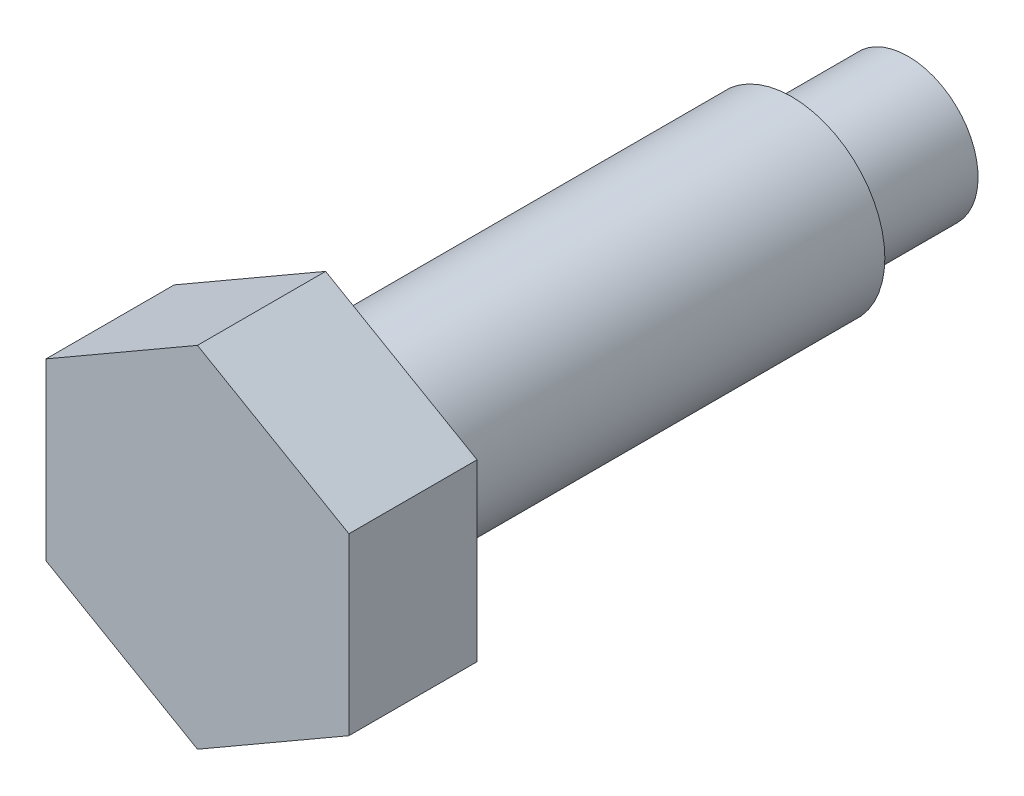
ISO-10303-21;
HEADER;
FILE_DESCRIPTION(('STEP AP214'),'2;1');
FILE_NAME('part.step','',(''),(''),'','','');
FILE_SCHEMA(('AUTOMOTIVE_DESIGN { 1 0 10303 214 1 1 1 1 }'));
ENDSEC;
DATA;
#1=APPLICATION_CONTEXT('core data for automotive mechanical design processes');
#2=APPLICATION_PROTOCOL_DEFINITION('international standard','automotive_design',2000,#1);
#3=PRODUCT_CONTEXT('',#1,'mechanical');
#4=PRODUCT('Part','Part','',(#3));
#5=PRODUCT_RELATED_PRODUCT_CATEGORY('part','',(#4));
#6=PRODUCT_DEFINITION_FORMATION('','',#4);
#7=PRODUCT_DEFINITION_CONTEXT('part definition',#1,'design');
#8=PRODUCT_DEFINITION('design','',#6,#7);
#9=PRODUCT_DEFINITION_SHAPE('','',#8);
#10=(LENGTH_UNIT() NAMED_UNIT(*) SI_UNIT(.MILLI.,.METRE.));
#11=(NAMED_UNIT(*) PLANE_ANGLE_UNIT() SI_UNIT($,.RADIAN.));
#12=(NAMED_UNIT(*) SI_UNIT($,.STERADIAN.) SOLID_ANGLE_UNIT());
#13=UNCERTAINTY_MEASURE_WITH_UNIT(LENGTH_MEASURE(1.E-05),#10,'distance_accuracy_value','');
#14=(GEOMETRIC_REPRESENTATION_CONTEXT(3) GLOBAL_UNCERTAINTY_ASSIGNED_CONTEXT((#13)) GLOBAL_UNIT_ASSIGNED_CONTEXT((#10,
#11,#12)) REPRESENTATION_CONTEXT('',''));
#15=CARTESIAN_POINT('',(0.,0.,0.));
#16=DIRECTION('',(0.,0.,1.));
#17=DIRECTION('',(1.,0.,0.));
#18=AXIS2_PLACEMENT_3D('',#15,#16,#17);
#19=CARTESIAN_POINT('',(0.,-7.50555349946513,0.));
#20=DIRECTION('',(0.,0.,1.));
#21=DIRECTION('',(0.,1.,0.));
#22=AXIS2_PLACEMENT_3D('',#19,#20,#21);
#23=PLANE('',#22);
#24=DIRECTION('',(0.866025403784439,-0.5,0.));
#25=VECTOR('',#24,1.);
#26=CARTESIAN_POINT('',(-6.5,-3.75277674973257,0.));
#27=LINE('',#26,#25);
#28=CARTESIAN_POINT('',(-6.5,-3.75277674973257,0.));
#29=VERTEX_POINT('',#28);
#30=CARTESIAN_POINT('',(0.,-7.50555349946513,0.));
#31=VERTEX_POINT('',#30);
#32=EDGE_CURVE('E72',#29,#31,#27,.T.);
#33=ORIENTED_EDGE('',*,*,#32,.F.);
#34=DIRECTION('',(0.,-1.,0.));
#35=VECTOR('',#34,1.);
#36=CARTESIAN_POINT('',(-6.5,3.75277674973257,0.));
#37=LINE('',#36,#35);
#38=CARTESIAN_POINT('',(-6.5,3.75277674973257,0.));
#39=VERTEX_POINT('',#38);
#40=EDGE_CURVE('E99',#39,#29,#37,.T.);
#41=ORIENTED_EDGE('',*,*,#40,.F.);
#42=DIRECTION('',(-0.866025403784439,-0.5,0.));
#43=VECTOR('',#42,1.);
#44=CARTESIAN_POINT('',(0.,7.50555349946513,0.));
#45=LINE('',#44,#43);
#46=CARTESIAN_POINT('',(0.,7.50555349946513,0.));
#47=VERTEX_POINT('',#46);
#48=EDGE_CURVE('E97',#47,#39,#45,.T.);
#49=ORIENTED_EDGE('',*,*,#48,.F.);
#50=DIRECTION('',(-0.866025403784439,0.5,0.));
#51=VECTOR('',#50,1.);
#52=CARTESIAN_POINT('',(6.5,3.75277674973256,0.));
#53=LINE('',#52,#51);
#54=CARTESIAN_POINT('',(6.5,3.75277674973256,0.));
#55=VERTEX_POINT('',#54);
#56=EDGE_CURVE('E95',#55,#47,#53,.T.);
#57=ORIENTED_EDGE('',*,*,#56,.F.);
#58=DIRECTION('',(0.,1.,0.));
#59=VECTOR('',#58,1.);
#60=CARTESIAN_POINT('',(6.5,-3.75277674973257,0.));
#61=LINE('',#60,#59);
#62=CARTESIAN_POINT('',(6.5,-3.75277674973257,0.));
#63=VERTEX_POINT('',#62);
#64=EDGE_CURVE('E74',#63,#55,#61,.T.);
#65=ORIENTED_EDGE('',*,*,#64,.F.);
#66=DIRECTION('',(0.866025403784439,0.5,0.));
#67=VECTOR('',#66,1.);
#68=CARTESIAN_POINT('',(0.,-7.50555349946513,0.));
#69=LINE('',#68,#67);
#70=EDGE_CURVE('E67',#31,#63,#69,.T.);
#71=ORIENTED_EDGE('',*,*,#70,.F.);
#72=EDGE_LOOP('',(#33,#41,#49,#57,#65,#71));
#73=FACE_BOUND('',#72,.T.);
#74=CARTESIAN_POINT('',(0.,0.,0.));
#75=DIRECTION('',(0.,0.,1.));
#76=DIRECTION('',(0.,1.,0.));
#77=AXIS2_PLACEMENT_3D('',#74,#75,#76);
#78=CIRCLE('',#77,4.);
#79=CARTESIAN_POINT('',(0.,4.,0.));
#80=VERTEX_POINT('',#79);
#81=EDGE_CURVE('E9',#80,#80,#78,.F.);
#82=ORIENTED_EDGE('',*,*,#81,.F.);
#83=EDGE_LOOP('',(#82));
#84=FACE_BOUND('',#83,.T.);
#85=ADVANCED_FACE('F14',(#73,#84),#23,.F.);
#86=CARTESIAN_POINT('',(-6.5,-3.75277674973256,5.5));
#87=DIRECTION('',(0.5,0.866025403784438,0.));
#88=DIRECTION('',(-0.866025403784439,0.5,0.));
#89=AXIS2_PLACEMENT_3D('',#86,#87,#88);
#90=PLANE('',#89);
#91=ORIENTED_EDGE('',*,*,#32,.T.);
#92=DIRECTION('',(0.,0.,-1.));
#93=VECTOR('',#92,1.);
#94=CARTESIAN_POINT('',(0.,-7.50555349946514,5.5));
#95=LINE('',#94,#93);
#96=CARTESIAN_POINT('',(0.,-7.50555349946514,5.5));
#97=VERTEX_POINT('',#96);
#98=EDGE_CURVE('E22',#97,#31,#95,.T.);
#99=ORIENTED_EDGE('',*,*,#98,.F.);
#100=DIRECTION('',(0.866025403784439,-0.5,0.));
#101=VECTOR('',#100,1.);
#102=CARTESIAN_POINT('',(-6.5,-3.75277674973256,5.5));
#103=LINE('',#102,#101);
#104=CARTESIAN_POINT('',(-6.5,-3.75277674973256,5.5));
#105=VERTEX_POINT('',#104);
#106=EDGE_CURVE('E101',#105,#97,#103,.T.);
#107=ORIENTED_EDGE('',*,*,#106,.F.);
#108=DIRECTION('',(0.,0.,-1.));
#109=VECTOR('',#108,1.);
#110=CARTESIAN_POINT('',(-6.5,-3.75277674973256,5.5));
#111=LINE('',#110,#109);
#112=EDGE_CURVE('E86',#105,#29,#111,.T.);
#113=ORIENTED_EDGE('',*,*,#112,.T.);
#114=EDGE_LOOP('',(#91,#99,#107,#113));
#115=FACE_BOUND('',#114,.T.);
#116=ADVANCED_FACE('F16',(#115),#90,.F.);
#117=CARTESIAN_POINT('',(0.,-7.50555349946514,5.5));
#118=DIRECTION('',(-0.5,0.866025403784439,0.));
#119=DIRECTION('',(-0.866025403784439,-0.5,0.));
#120=AXIS2_PLACEMENT_3D('',#117,#118,#119);
#121=PLANE('',#120);
#122=ORIENTED_EDGE('',*,*,#70,.T.);
#123=DIRECTION('',(0.,0.,-1.));
#124=VECTOR('',#123,1.);
#125=CARTESIAN_POINT('',(6.5,-3.75277674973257,5.5));
#126=LINE('',#125,#124);
#127=CARTESIAN_POINT('',(6.5,-3.75277674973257,5.5));
#128=VERTEX_POINT('',#127);
#129=EDGE_CURVE('E84',#128,#63,#126,.T.);
#130=ORIENTED_EDGE('',*,*,#129,.F.);
#131=DIRECTION('',(0.866025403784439,0.5,0.));
#132=VECTOR('',#131,1.);
#133=CARTESIAN_POINT('',(0.,-7.50555349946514,5.5));
#134=LINE('',#133,#132);
#135=EDGE_CURVE('E81',#97,#128,#134,.T.);
#136=ORIENTED_EDGE('',*,*,#135,.F.);
#137=ORIENTED_EDGE('',*,*,#98,.T.);
#138=EDGE_LOOP('',(#122,#130,#136,#137));
#139=FACE_BOUND('',#138,.T.);
#140=ADVANCED_FACE('F80',(#139),#121,.F.);
#141=CARTESIAN_POINT('',(6.5,-3.75277674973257,5.5));
#142=DIRECTION('',(-1.,0.,0.));
#143=DIRECTION('',(0.,-1.,0.));
#144=AXIS2_PLACEMENT_3D('',#141,#142,#143);
#145=PLANE('',#144);
#146=ORIENTED_EDGE('',*,*,#64,.T.);
#147=DIRECTION('',(0.,0.,-1.));
#148=VECTOR('',#147,1.);
#149=CARTESIAN_POINT('',(6.5,3.75277674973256,5.5));
#150=LINE('',#149,#148);
#151=CARTESIAN_POINT('',(6.5,3.75277674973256,5.5));
#152=VERTEX_POINT('',#151);
#153=EDGE_CURVE('E117',#152,#55,#150,.T.);
#154=ORIENTED_EDGE('',*,*,#153,.F.);
#155=DIRECTION('',(0.,1.,0.));
#156=VECTOR('',#155,1.);
#157=CARTESIAN_POINT('',(6.5,-3.75277674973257,5.5));
#158=LINE('',#157,#156);
#159=EDGE_CURVE('E104',#128,#152,#158,.T.);
#160=ORIENTED_EDGE('',*,*,#159,.F.);
#161=ORIENTED_EDGE('',*,*,#129,.T.);
#162=EDGE_LOOP('',(#146,#154,#160,#161));
#163=FACE_BOUND('',#162,.T.);
#164=ADVANCED_FACE('F122',(#163),#145,.F.);
#165=CARTESIAN_POINT('',(6.5,3.75277674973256,5.5));
#166=DIRECTION('',(-0.5,-0.866025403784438,0.));
#167=DIRECTION('',(0.866025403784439,-0.5,0.));
#168=AXIS2_PLACEMENT_3D('',#165,#166,#167);
#169=PLANE('',#168);
#170=ORIENTED_EDGE('',*,*,#56,.T.);
#171=DIRECTION('',(0.,0.,-1.));
#172=VECTOR('',#171,1.);
#173=CARTESIAN_POINT('',(0.,7.50555349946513,5.5));
#174=LINE('',#173,#172);
#175=CARTESIAN_POINT('',(0.,7.50555349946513,5.5));
#176=VERTEX_POINT('',#175);
#177=EDGE_CURVE('E114',#176,#47,#174,.T.);
#178=ORIENTED_EDGE('',*,*,#177,.F.);
#179=DIRECTION('',(-0.866025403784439,0.5,0.));
#180=VECTOR('',#179,1.);
#181=CARTESIAN_POINT('',(6.5,3.75277674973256,5.5));
#182=LINE('',#181,#180);
#183=EDGE_CURVE('E106',#152,#176,#182,.T.);
#184=ORIENTED_EDGE('',*,*,#183,.F.);
#185=ORIENTED_EDGE('',*,*,#153,.T.);
#186=EDGE_LOOP('',(#170,#178,#184,#185));
#187=FACE_BOUND('',#186,.T.);
#188=ADVANCED_FACE('F128',(#187),#169,.F.);
#189=CARTESIAN_POINT('',(0.,7.50555349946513,5.5));
#190=DIRECTION('',(0.5,-0.866025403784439,0.));
#191=DIRECTION('',(0.866025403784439,0.5,0.));
#192=AXIS2_PLACEMENT_3D('',#189,#190,#191);
#193=PLANE('',#192);
#194=ORIENTED_EDGE('',*,*,#48,.T.);
#195=DIRECTION('',(0.,0.,-1.));
#196=VECTOR('',#195,1.);
#197=CARTESIAN_POINT('',(-6.5,3.75277674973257,5.5));
#198=LINE('',#197,#196);
#199=CARTESIAN_POINT('',(-6.5,3.75277674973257,5.5));
#200=VERTEX_POINT('',#199);
#201=EDGE_CURVE('E111',#200,#39,#198,.T.);
#202=ORIENTED_EDGE('',*,*,#201,.F.);
#203=DIRECTION('',(-0.866025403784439,-0.5,0.));
#204=VECTOR('',#203,1.);
#205=CARTESIAN_POINT('',(0.,7.50555349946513,5.5));
#206=LINE('',#205,#204);
#207=EDGE_CURVE('E34',#176,#200,#206,.T.);
#208=ORIENTED_EDGE('',*,*,#207,.F.);
#209=ORIENTED_EDGE('',*,*,#177,.T.);
#210=EDGE_LOOP('',(#194,#202,#208,#209));
#211=FACE_BOUND('',#210,.T.);
#212=ADVANCED_FACE('F131',(#211),#193,.F.);
#213=CARTESIAN_POINT('',(-6.5,3.75277674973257,5.5));
#214=DIRECTION('',(1.,0.,0.));
#215=DIRECTION('',(0.,1.,0.));
#216=AXIS2_PLACEMENT_3D('',#213,#214,#215);
#217=PLANE('',#216);
#218=ORIENTED_EDGE('',*,*,#40,.T.);
#219=ORIENTED_EDGE('',*,*,#112,.F.);
#220=DIRECTION('',(0.,-1.,0.));
#221=VECTOR('',#220,1.);
#222=CARTESIAN_POINT('',(-6.5,3.75277674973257,5.5));
#223=LINE('',#222,#221);
#224=EDGE_CURVE('E29',#200,#105,#223,.T.);
#225=ORIENTED_EDGE('',*,*,#224,.F.);
#226=ORIENTED_EDGE('',*,*,#201,.T.);
#227=EDGE_LOOP('',(#218,#219,#225,#226));
#228=FACE_BOUND('',#227,.T.);
#229=ADVANCED_FACE('F133',(#228),#217,.F.);
#230=CARTESIAN_POINT('',(0.,-7.50555349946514,5.5));
#231=DIRECTION('',(0.,0.,1.));
#232=DIRECTION('',(0.,1.,0.));
#233=AXIS2_PLACEMENT_3D('',#230,#231,#232);
#234=PLANE('',#233);
#235=ORIENTED_EDGE('',*,*,#106,.T.);
#236=ORIENTED_EDGE('',*,*,#135,.T.);
#237=ORIENTED_EDGE('',*,*,#159,.T.);
#238=ORIENTED_EDGE('',*,*,#183,.T.);
#239=ORIENTED_EDGE('',*,*,#207,.T.);
#240=ORIENTED_EDGE('',*,*,#224,.T.);
#241=EDGE_LOOP('',(#235,#236,#237,#238,#239,#240));
#242=FACE_BOUND('',#241,.T.);
#243=ADVANCED_FACE('F125',(#242),#234,.T.);
#244=CARTESIAN_POINT('',(0.,0.,0.));
#245=DIRECTION('',(0.,0.,1.));
#246=DIRECTION('',(0.,1.,0.));
#247=AXIS2_PLACEMENT_3D('',#244,#245,#246);
#248=CYLINDRICAL_SURFACE('',#247,4.);
#249=ORIENTED_EDGE('',*,*,#81,.T.);
#250=EDGE_LOOP('',(#249));
#251=FACE_BOUND('',#250,.T.);
#252=CARTESIAN_POINT('',(0.,0.,-20.));
#253=DIRECTION('',(0.,0.,1.));
#254=DIRECTION('',(0.,1.,0.));
#255=AXIS2_PLACEMENT_3D('',#252,#253,#254);
#256=CIRCLE('',#255,4.);
#257=CARTESIAN_POINT('',(0.,4.,-20.));
#258=VERTEX_POINT('',#257);
#259=EDGE_CURVE('E87',#258,#258,#256,.T.);
#260=ORIENTED_EDGE('',*,*,#259,.T.);
#261=EDGE_LOOP('',(#260));
#262=FACE_BOUND('',#261,.T.);
#263=ADVANCED_FACE('F142',(#251,#262),#248,.T.);
#264=CARTESIAN_POINT('',(0.,0.,-20.5773502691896));
#265=DIRECTION('',(0.,0.,1.));
#266=DIRECTION('',(0.,1.,0.));
#267=AXIS2_PLACEMENT_3D('',#264,#265,#266);
#268=CONICAL_SURFACE('',#267,3.,1.0471975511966);
#269=ORIENTED_EDGE('',*,*,#259,.F.);
#270=EDGE_LOOP('',(#269));
#271=FACE_BOUND('',#270,.T.);
#272=CARTESIAN_POINT('',(0.,0.,-20.5773502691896));
#273=DIRECTION('',(0.,0.,1.));
#274=DIRECTION('',(0.,1.,0.));
#275=AXIS2_PLACEMENT_3D('',#272,#273,#274);
#276=CIRCLE('',#275,3.);
#277=CARTESIAN_POINT('',(0.,3.,-20.5773502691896));
#278=VERTEX_POINT('',#277);
#279=EDGE_CURVE('E90',#278,#278,#276,.T.);
#280=ORIENTED_EDGE('',*,*,#279,.T.);
#281=EDGE_LOOP('',(#280));
#282=FACE_BOUND('',#281,.T.);
#283=ADVANCED_FACE('F154',(#271,#282),#268,.T.);
#284=CARTESIAN_POINT('',(0.,0.,0.));
#285=DIRECTION('',(0.,0.,1.));
#286=DIRECTION('',(0.,1.,0.));
#287=AXIS2_PLACEMENT_3D('',#284,#285,#286);
#288=CYLINDRICAL_SURFACE('',#287,3.);
#289=ORIENTED_EDGE('',*,*,#279,.F.);
#290=EDGE_LOOP('',(#289));
#291=FACE_BOUND('',#290,.T.);
#292=CARTESIAN_POINT('',(0.,0.,-25.));
#293=DIRECTION('',(0.,0.,1.));
#294=DIRECTION('',(0.,1.,0.));
#295=AXIS2_PLACEMENT_3D('',#292,#293,#294);
#296=CIRCLE('',#295,3.);
#297=CARTESIAN_POINT('',(0.,3.,-25.));
#298=VERTEX_POINT('',#297);
#299=EDGE_CURVE('E171',#298,#298,#296,.T.);
#300=ORIENTED_EDGE('',*,*,#299,.T.);
#301=EDGE_LOOP('',(#300));
#302=FACE_BOUND('',#301,.T.);
#303=ADVANCED_FACE('F158',(#291,#302),#288,.T.);
#304=CARTESIAN_POINT('',(0.,0.,-21.));
#305=DIRECTION('',(0.,0.,1.));
#306=DIRECTION('',(-1.,0.,0.));
#307=AXIS2_PLACEMENT_3D('',#304,#305,#306);
#308=SPHERICAL_SURFACE('',#307,5.);
#309=ORIENTED_EDGE('',*,*,#299,.F.);
#310=EDGE_LOOP('',(#309));
#311=FACE_BOUND('',#310,.T.);
#312=ADVANCED_FACE('F162',(#311),#308,.T.);
#313=CLOSED_SHELL('',(#85,#116,#140,#164,#188,#212,#229,#243,#263,#283,#303,#312));
#314=MANIFOLD_SOLID_BREP('B1',#313);
#315=ADVANCED_BREP_SHAPE_REPRESENTATION('',(#18,#314),#14);
#316=SHAPE_DEFINITION_REPRESENTATION(#9,#315);
ENDSEC;
END-ISO-10303-21;
